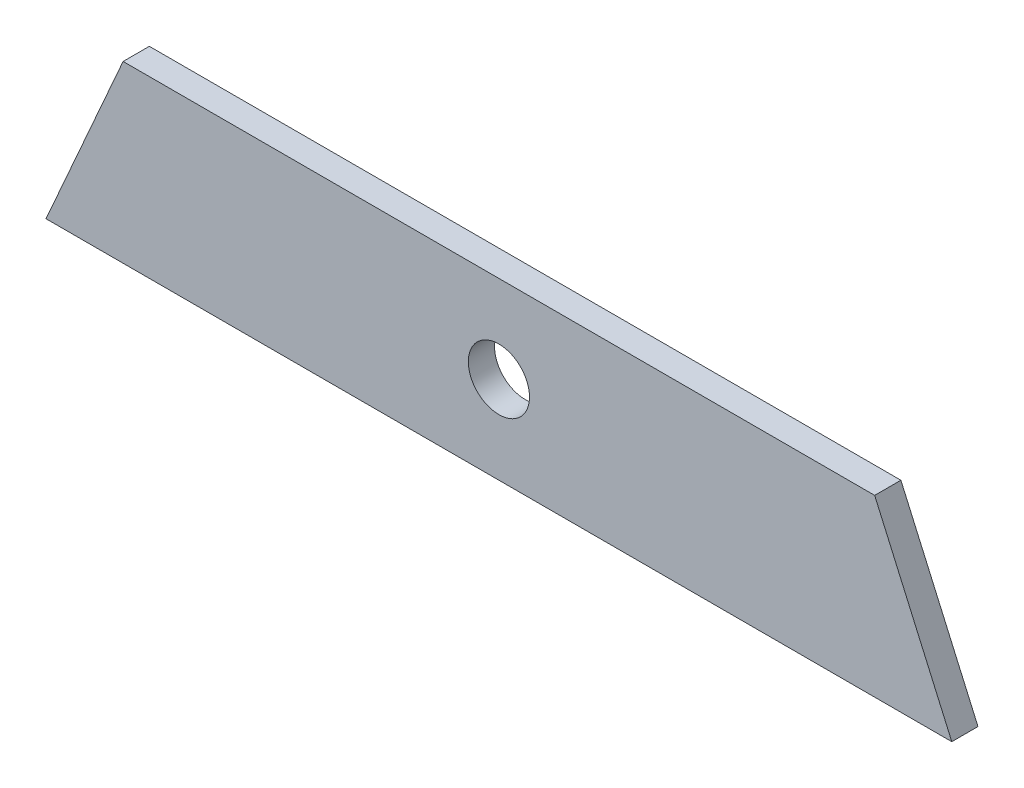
ISO-10303-21;
HEADER;
FILE_DESCRIPTION(('STEP AP214'),'2;1');
FILE_NAME('part.step','',(''),(''),'','','');
FILE_SCHEMA(('AUTOMOTIVE_DESIGN { 1 0 10303 214 1 1 1 1 }'));
ENDSEC;
DATA;
#1=APPLICATION_CONTEXT('core data for automotive mechanical design processes');
#2=APPLICATION_PROTOCOL_DEFINITION('international standard','automotive_design',2000,#1);
#3=PRODUCT_CONTEXT('',#1,'mechanical');
#4=PRODUCT('Part','Part','',(#3));
#5=PRODUCT_RELATED_PRODUCT_CATEGORY('part','',(#4));
#6=PRODUCT_DEFINITION_FORMATION('','',#4);
#7=PRODUCT_DEFINITION_CONTEXT('part definition',#1,'design');
#8=PRODUCT_DEFINITION('design','',#6,#7);
#9=PRODUCT_DEFINITION_SHAPE('','',#8);
#10=(LENGTH_UNIT() NAMED_UNIT(*) SI_UNIT(.MILLI.,.METRE.));
#11=(NAMED_UNIT(*) PLANE_ANGLE_UNIT() SI_UNIT($,.RADIAN.));
#12=(NAMED_UNIT(*) SI_UNIT($,.STERADIAN.) SOLID_ANGLE_UNIT());
#13=UNCERTAINTY_MEASURE_WITH_UNIT(LENGTH_MEASURE(1.E-05),#10,'distance_accuracy_value','');
#14=(GEOMETRIC_REPRESENTATION_CONTEXT(3) GLOBAL_UNCERTAINTY_ASSIGNED_CONTEXT((#13)) GLOBAL_UNIT_ASSIGNED_CONTEXT((#10,
#11,#12)) REPRESENTATION_CONTEXT('',''));
#15=CARTESIAN_POINT('',(0.,0.,0.));
#16=DIRECTION('',(0.,0.,1.));
#17=DIRECTION('',(1.,0.,0.));
#18=AXIS2_PLACEMENT_3D('',#15,#16,#17);
#19=CARTESIAN_POINT('',(-42.9999999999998,20.,3.));
#20=DIRECTION('',(0.,0.,-1.));
#21=DIRECTION('',(-1.,0.,0.));
#22=AXIS2_PLACEMENT_3D('',#19,#20,#21);
#23=PLANE('',#22);
#24=DIRECTION('',(0.403625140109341,0.914924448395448,0.));
#25=VECTOR('',#24,1.);
#26=CARTESIAN_POINT('',(-51.8231359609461,0.,3.));
#27=LINE('',#26,#25);
#28=CARTESIAN_POINT('',(-51.8231359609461,0.,3.));
#29=VERTEX_POINT('',#28);
#30=CARTESIAN_POINT('',(-42.9999999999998,20.,3.));
#31=VERTEX_POINT('',#30);
#32=EDGE_CURVE('E72',#29,#31,#27,.T.);
#33=ORIENTED_EDGE('',*,*,#32,.F.);
#34=DIRECTION('',(-1.,0.,0.));
#35=VECTOR('',#34,1.);
#36=CARTESIAN_POINT('',(51.8231359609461,0.,3.));
#37=LINE('',#36,#35);
#38=CARTESIAN_POINT('',(51.8231359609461,0.,3.));
#39=VERTEX_POINT('',#38);
#40=EDGE_CURVE('E78',#39,#29,#37,.T.);
#41=ORIENTED_EDGE('',*,*,#40,.F.);
#42=DIRECTION('',(0.403625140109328,-0.914924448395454,0.));
#43=VECTOR('',#42,1.);
#44=CARTESIAN_POINT('',(43.0000000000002,20.,3.));
#45=LINE('',#44,#43);
#46=CARTESIAN_POINT('',(43.0000000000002,20.,3.));
#47=VERTEX_POINT('',#46);
#48=EDGE_CURVE('E100',#47,#39,#45,.T.);
#49=ORIENTED_EDGE('',*,*,#48,.F.);
#50=DIRECTION('',(1.,0.,0.));
#51=VECTOR('',#50,1.);
#52=CARTESIAN_POINT('',(-42.9999999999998,20.,3.));
#53=LINE('',#52,#51);
#54=EDGE_CURVE('E98',#31,#47,#53,.T.);
#55=ORIENTED_EDGE('',*,*,#54,.F.);
#56=EDGE_LOOP('',(#33,#41,#49,#55));
#57=FACE_BOUND('',#56,.T.);
#58=CARTESIAN_POINT('',(0.,10.,3.));
#59=DIRECTION('',(0.,0.,1.));
#60=DIRECTION('',(1.,0.,0.));
#61=AXIS2_PLACEMENT_3D('',#58,#59,#60);
#62=CIRCLE('',#61,3.5);
#63=CARTESIAN_POINT('',(3.5,10.,3.));
#64=VERTEX_POINT('',#63);
#65=EDGE_CURVE('E88',#64,#64,#62,.T.);
#66=ORIENTED_EDGE('',*,*,#65,.F.);
#67=EDGE_LOOP('',(#66));
#68=FACE_BOUND('',#67,.T.);
#69=ADVANCED_FACE('F30',(#57,#68),#23,.F.);
#70=CARTESIAN_POINT('',(-42.9999999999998,20.,0.));
#71=DIRECTION('',(0.,0.,-1.));
#72=DIRECTION('',(-1.,0.,0.));
#73=AXIS2_PLACEMENT_3D('',#70,#71,#72);
#74=PLANE('',#73);
#75=DIRECTION('',(0.403625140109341,0.914924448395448,0.));
#76=VECTOR('',#75,1.);
#77=CARTESIAN_POINT('',(-51.8231359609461,0.,0.));
#78=LINE('',#77,#76);
#79=CARTESIAN_POINT('',(-51.8231359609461,0.,0.));
#80=VERTEX_POINT('',#79);
#81=CARTESIAN_POINT('',(-42.9999999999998,20.,0.));
#82=VERTEX_POINT('',#81);
#83=EDGE_CURVE('E70',#80,#82,#78,.T.);
#84=ORIENTED_EDGE('',*,*,#83,.T.);
#85=DIRECTION('',(1.,0.,0.));
#86=VECTOR('',#85,1.);
#87=CARTESIAN_POINT('',(-42.9999999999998,20.,0.));
#88=LINE('',#87,#86);
#89=CARTESIAN_POINT('',(43.0000000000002,20.,0.));
#90=VERTEX_POINT('',#89);
#91=EDGE_CURVE('E85',#82,#90,#88,.T.);
#92=ORIENTED_EDGE('',*,*,#91,.T.);
#93=DIRECTION('',(0.403625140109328,-0.914924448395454,0.));
#94=VECTOR('',#93,1.);
#95=CARTESIAN_POINT('',(43.0000000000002,20.,0.));
#96=LINE('',#95,#94);
#97=CARTESIAN_POINT('',(51.8231359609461,0.,0.));
#98=VERTEX_POINT('',#97);
#99=EDGE_CURVE('E91',#90,#98,#96,.T.);
#100=ORIENTED_EDGE('',*,*,#99,.T.);
#101=DIRECTION('',(-1.,0.,0.));
#102=VECTOR('',#101,1.);
#103=CARTESIAN_POINT('',(51.8231359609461,0.,0.));
#104=LINE('',#103,#102);
#105=EDGE_CURVE('E87',#98,#80,#104,.T.);
#106=ORIENTED_EDGE('',*,*,#105,.T.);
#107=EDGE_LOOP('',(#84,#92,#100,#106));
#108=FACE_BOUND('',#107,.T.);
#109=CARTESIAN_POINT('',(0.,10.,0.));
#110=DIRECTION('',(0.,0.,1.));
#111=DIRECTION('',(1.,0.,0.));
#112=AXIS2_PLACEMENT_3D('',#109,#110,#111);
#113=CIRCLE('',#112,3.5);
#114=CARTESIAN_POINT('',(3.5,10.,0.));
#115=VERTEX_POINT('',#114);
#116=EDGE_CURVE('E114',#115,#115,#113,.T.);
#117=ORIENTED_EDGE('',*,*,#116,.T.);
#118=EDGE_LOOP('',(#117));
#119=FACE_BOUND('',#118,.T.);
#120=ADVANCED_FACE('F82',(#108,#119),#74,.T.);
#121=CARTESIAN_POINT('',(-51.8231359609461,0.,3.));
#122=DIRECTION('',(-0.914924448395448,0.403625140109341,0.));
#123=DIRECTION('',(-0.403625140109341,-0.914924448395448,0.));
#124=AXIS2_PLACEMENT_3D('',#121,#122,#123);
#125=PLANE('',#124);
#126=DIRECTION('',(0.,0.,-1.));
#127=VECTOR('',#126,1.);
#128=CARTESIAN_POINT('',(-51.8231359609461,0.,3.));
#129=LINE('',#128,#127);
#130=EDGE_CURVE('E11',#29,#80,#129,.T.);
#131=ORIENTED_EDGE('',*,*,#130,.F.);
#132=ORIENTED_EDGE('',*,*,#32,.T.);
#133=DIRECTION('',(0.,0.,-1.));
#134=VECTOR('',#133,1.);
#135=CARTESIAN_POINT('',(-42.9999999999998,20.,3.));
#136=LINE('',#135,#134);
#137=EDGE_CURVE('E67',#31,#82,#136,.T.);
#138=ORIENTED_EDGE('',*,*,#137,.T.);
#139=ORIENTED_EDGE('',*,*,#83,.F.);
#140=EDGE_LOOP('',(#131,#132,#138,#139));
#141=FACE_BOUND('',#140,.T.);
#142=ADVANCED_FACE('F69',(#141),#125,.T.);
#143=CARTESIAN_POINT('',(51.8231359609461,0.,3.));
#144=DIRECTION('',(0.,-1.,0.));
#145=DIRECTION('',(1.,0.,0.));
#146=AXIS2_PLACEMENT_3D('',#143,#144,#145);
#147=PLANE('',#146);
#148=DIRECTION('',(0.,0.,-1.));
#149=VECTOR('',#148,1.);
#150=CARTESIAN_POINT('',(51.8231359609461,0.,3.));
#151=LINE('',#150,#149);
#152=EDGE_CURVE('E38',#39,#98,#151,.T.);
#153=ORIENTED_EDGE('',*,*,#152,.F.);
#154=ORIENTED_EDGE('',*,*,#40,.T.);
#155=ORIENTED_EDGE('',*,*,#130,.T.);
#156=ORIENTED_EDGE('',*,*,#105,.F.);
#157=EDGE_LOOP('',(#153,#154,#155,#156));
#158=FACE_BOUND('',#157,.T.);
#159=ADVANCED_FACE('F32',(#158),#147,.T.);
#160=CARTESIAN_POINT('',(43.0000000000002,20.,3.));
#161=DIRECTION('',(0.914924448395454,0.403625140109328,0.));
#162=DIRECTION('',(-0.403625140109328,0.914924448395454,0.));
#163=AXIS2_PLACEMENT_3D('',#160,#161,#162);
#164=PLANE('',#163);
#165=DIRECTION('',(0.,0.,-1.));
#166=VECTOR('',#165,1.);
#167=CARTESIAN_POINT('',(43.0000000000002,20.,3.));
#168=LINE('',#167,#166);
#169=EDGE_CURVE('E77',#47,#90,#168,.T.);
#170=ORIENTED_EDGE('',*,*,#169,.F.);
#171=ORIENTED_EDGE('',*,*,#48,.T.);
#172=ORIENTED_EDGE('',*,*,#152,.T.);
#173=ORIENTED_EDGE('',*,*,#99,.F.);
#174=EDGE_LOOP('',(#170,#171,#172,#173));
#175=FACE_BOUND('',#174,.T.);
#176=ADVANCED_FACE('F104',(#175),#164,.T.);
#177=CARTESIAN_POINT('',(-42.9999999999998,20.,3.));
#178=DIRECTION('',(0.,1.,0.));
#179=DIRECTION('',(0.,0.,1.));
#180=AXIS2_PLACEMENT_3D('',#177,#178,#179);
#181=PLANE('',#180);
#182=ORIENTED_EDGE('',*,*,#54,.T.);
#183=ORIENTED_EDGE('',*,*,#169,.T.);
#184=ORIENTED_EDGE('',*,*,#91,.F.);
#185=ORIENTED_EDGE('',*,*,#137,.F.);
#186=EDGE_LOOP('',(#182,#183,#184,#185));
#187=FACE_BOUND('',#186,.T.);
#188=ADVANCED_FACE('F90',(#187),#181,.T.);
#189=CARTESIAN_POINT('',(0.,10.,3.));
#190=DIRECTION('',(0.,0.,-1.));
#191=DIRECTION('',(-1.,0.,0.));
#192=AXIS2_PLACEMENT_3D('',#189,#190,#191);
#193=CYLINDRICAL_SURFACE('',#192,3.5);
#194=ORIENTED_EDGE('',*,*,#65,.T.);
#195=EDGE_LOOP('',(#194));
#196=FACE_BOUND('',#195,.T.);
#197=ORIENTED_EDGE('',*,*,#116,.F.);
#198=EDGE_LOOP('',(#197));
#199=FACE_BOUND('',#198,.T.);
#200=ADVANCED_FACE('F119',(#196,#199),#193,.F.);
#201=CLOSED_SHELL('',(#69,#120,#142,#159,#176,#188,#200));
#202=MANIFOLD_SOLID_BREP('B2',#201);
#203=ADVANCED_BREP_SHAPE_REPRESENTATION('',(#18,#202),#14);
#204=SHAPE_DEFINITION_REPRESENTATION(#9,#203);
ENDSEC;
END-ISO-10303-21;
